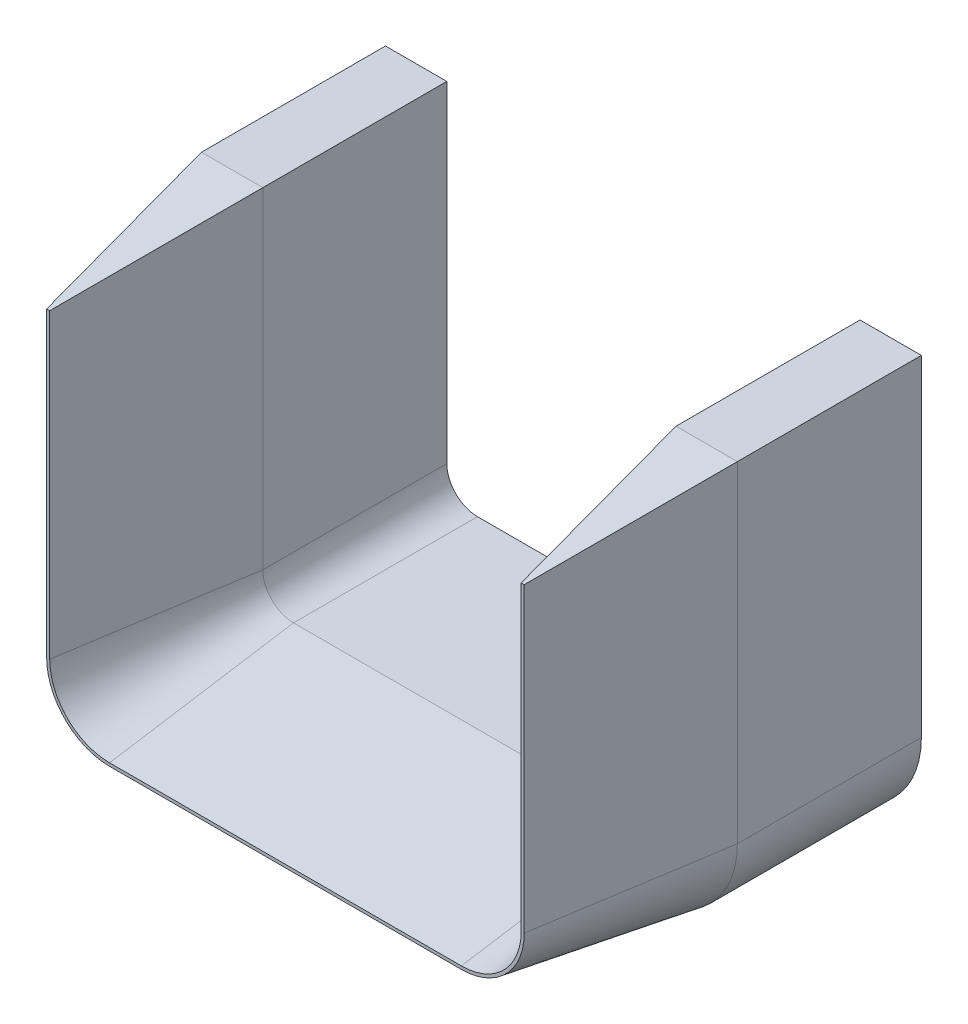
ISO-10303-21;
HEADER;
FILE_DESCRIPTION(('STEP AP214'),'2;1');
FILE_NAME('part.step','',(''),(''),'','','');
FILE_SCHEMA(('AUTOMOTIVE_DESIGN { 1 0 10303 214 1 1 1 1 }'));
ENDSEC;
DATA;
#1=APPLICATION_CONTEXT('core data for automotive mechanical design processes');
#2=APPLICATION_PROTOCOL_DEFINITION('international standard','automotive_design',2000,#1);
#3=PRODUCT_CONTEXT('',#1,'mechanical');
#4=PRODUCT('Part','Part','',(#3));
#5=PRODUCT_RELATED_PRODUCT_CATEGORY('part','',(#4));
#6=PRODUCT_DEFINITION_FORMATION('','',#4);
#7=PRODUCT_DEFINITION_CONTEXT('part definition',#1,'design');
#8=PRODUCT_DEFINITION('design','',#6,#7);
#9=PRODUCT_DEFINITION_SHAPE('','',#8);
#10=(LENGTH_UNIT() NAMED_UNIT(*) SI_UNIT(.MILLI.,.METRE.));
#11=(NAMED_UNIT(*) PLANE_ANGLE_UNIT() SI_UNIT($,.RADIAN.));
#12=(NAMED_UNIT(*) SI_UNIT($,.STERADIAN.) SOLID_ANGLE_UNIT());
#13=UNCERTAINTY_MEASURE_WITH_UNIT(LENGTH_MEASURE(1.E-05),#10,'distance_accuracy_value','');
#14=(GEOMETRIC_REPRESENTATION_CONTEXT(3) GLOBAL_UNCERTAINTY_ASSIGNED_CONTEXT((#13)) GLOBAL_UNIT_ASSIGNED_CONTEXT((#10,
#11,#12)) REPRESENTATION_CONTEXT('',''));
#15=CARTESIAN_POINT('',(0.,0.,0.));
#16=DIRECTION('',(0.,0.,1.));
#17=DIRECTION('',(1.,0.,0.));
#18=AXIS2_PLACEMENT_3D('',#15,#16,#17);
#19=CARTESIAN_POINT('',(-28.2698996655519,24.9115384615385,-30.));
#20=DIRECTION('',(1.,0.,0.));
#21=DIRECTION('',(0.,0.,-1.));
#22=AXIS2_PLACEMENT_3D('',#19,#20,#21);
#23=PLANE('',#22);
#24=DIRECTION('',(0.,1.,0.));
#25=VECTOR('',#24,1.);
#26=CARTESIAN_POINT('',(-28.2698996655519,24.9115384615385,0.));
#27=LINE('',#26,#25);
#28=CARTESIAN_POINT('',(-28.2698996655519,-29.0464882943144,0.));
#29=VERTEX_POINT('',#28);
#30=CARTESIAN_POINT('',(-28.2698996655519,24.9115384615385,0.));
#31=VERTEX_POINT('',#30);
#32=EDGE_CURVE('E152',#29,#31,#27,.T.);
#33=ORIENTED_EDGE('',*,*,#32,.F.);
#34=DIRECTION('',(0.,0.,1.));
#35=VECTOR('',#34,1.);
#36=CARTESIAN_POINT('',(-28.2698996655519,-29.0464882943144,-30.));
#37=LINE('',#36,#35);
#38=CARTESIAN_POINT('',(-28.2698996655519,-29.0464882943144,-30.));
#39=VERTEX_POINT('',#38);
#40=EDGE_CURVE('E11',#39,#29,#37,.T.);
#41=ORIENTED_EDGE('',*,*,#40,.F.);
#42=DIRECTION('',(0.,1.,0.));
#43=VECTOR('',#42,1.);
#44=CARTESIAN_POINT('',(-28.2698996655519,24.9115384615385,-30.));
#45=LINE('',#44,#43);
#46=CARTESIAN_POINT('',(-28.2698996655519,24.9115384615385,-30.));
#47=VERTEX_POINT('',#46);
#48=EDGE_CURVE('E179',#39,#47,#45,.T.);
#49=ORIENTED_EDGE('',*,*,#48,.T.);
#50=DIRECTION('',(0.,0.,1.));
#51=VECTOR('',#50,1.);
#52=CARTESIAN_POINT('',(-28.2698996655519,24.9115384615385,-30.));
#53=LINE('',#52,#51);
#54=EDGE_CURVE('E35',#47,#31,#53,.T.);
#55=ORIENTED_EDGE('',*,*,#54,.T.);
#56=EDGE_LOOP('',(#33,#41,#49,#55));
#57=FACE_BOUND('',#56,.T.);
#58=ADVANCED_FACE('F32',(#57),#23,.T.);
#59=CARTESIAN_POINT('',(-23.2698996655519,-29.0464882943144,-30.));
#60=DIRECTION('',(0.,0.,1.));
#61=DIRECTION('',(1.,0.,0.));
#62=AXIS2_PLACEMENT_3D('',#59,#60,#61);
#63=CYLINDRICAL_SURFACE('',#62,5.);
#64=CARTESIAN_POINT('',(-23.2698996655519,-29.0464882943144,0.));
#65=DIRECTION('',(0.,0.,1.));
#66=DIRECTION('',(1.,0.,0.));
#67=AXIS2_PLACEMENT_3D('',#64,#65,#66);
#68=CIRCLE('',#67,5.);
#69=CARTESIAN_POINT('',(-23.2698996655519,-34.0464882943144,0.));
#70=VERTEX_POINT('',#69);
#71=EDGE_CURVE('E177',#70,#29,#68,.F.);
#72=ORIENTED_EDGE('',*,*,#71,.F.);
#73=DIRECTION('',(0.,0.,1.));
#74=VECTOR('',#73,1.);
#75=CARTESIAN_POINT('',(-23.2698996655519,-34.0464882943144,-30.));
#76=LINE('',#75,#74);
#77=CARTESIAN_POINT('',(-23.2698996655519,-34.0464882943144,-30.));
#78=VERTEX_POINT('',#77);
#79=EDGE_CURVE('E41',#78,#70,#76,.T.);
#80=ORIENTED_EDGE('',*,*,#79,.F.);
#81=CARTESIAN_POINT('',(-23.2698996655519,-29.0464882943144,-30.));
#82=DIRECTION('',(0.,0.,1.));
#83=DIRECTION('',(1.,0.,0.));
#84=AXIS2_PLACEMENT_3D('',#81,#82,#83);
#85=CIRCLE('',#84,5.);
#86=EDGE_CURVE('E142',#78,#39,#85,.F.);
#87=ORIENTED_EDGE('',*,*,#86,.T.);
#88=ORIENTED_EDGE('',*,*,#40,.T.);
#89=EDGE_LOOP('',(#72,#80,#87,#88));
#90=FACE_BOUND('',#89,.T.);
#91=ADVANCED_FACE('F380',(#90),#63,.F.);
#92=CARTESIAN_POINT('',(-23.2698996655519,-34.0464882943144,-30.));
#93=DIRECTION('',(0.,1.,0.));
#94=DIRECTION('',(0.,0.,1.));
#95=AXIS2_PLACEMENT_3D('',#92,#93,#94);
#96=PLANE('',#95);
#97=DIRECTION('',(1.,0.,0.));
#98=VECTOR('',#97,1.);
#99=CARTESIAN_POINT('',(-23.2698996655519,-34.0464882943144,0.));
#100=LINE('',#99,#98);
#101=CARTESIAN_POINT('',(34.1010033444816,-34.0464882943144,0.));
#102=VERTEX_POINT('',#101);
#103=EDGE_CURVE('E132',#102,#70,#100,.F.);
#104=ORIENTED_EDGE('',*,*,#103,.F.);
#105=DIRECTION('',(0.,0.,1.));
#106=VECTOR('',#105,1.);
#107=CARTESIAN_POINT('',(34.1010033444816,-34.0464882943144,-30.));
#108=LINE('',#107,#106);
#109=CARTESIAN_POINT('',(34.1010033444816,-34.0464882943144,-30.));
#110=VERTEX_POINT('',#109);
#111=EDGE_CURVE('E88',#110,#102,#108,.T.);
#112=ORIENTED_EDGE('',*,*,#111,.F.);
#113=DIRECTION('',(1.,0.,0.));
#114=VECTOR('',#113,1.);
#115=CARTESIAN_POINT('',(-23.2698996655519,-34.0464882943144,-30.));
#116=LINE('',#115,#114);
#117=EDGE_CURVE('E129',#110,#78,#116,.F.);
#118=ORIENTED_EDGE('',*,*,#117,.T.);
#119=ORIENTED_EDGE('',*,*,#79,.T.);
#120=EDGE_LOOP('',(#104,#112,#118,#119));
#121=FACE_BOUND('',#120,.T.);
#122=ADVANCED_FACE('F128',(#121),#96,.T.);
#123=CARTESIAN_POINT('',(34.1010033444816,-29.0464882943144,-30.));
#124=DIRECTION('',(0.,0.,1.));
#125=DIRECTION('',(1.,0.,0.));
#126=AXIS2_PLACEMENT_3D('',#123,#124,#125);
#127=CYLINDRICAL_SURFACE('',#126,5.);
#128=CARTESIAN_POINT('',(34.1010033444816,-29.0464882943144,0.));
#129=DIRECTION('',(0.,0.,1.));
#130=DIRECTION('',(1.,0.,0.));
#131=AXIS2_PLACEMENT_3D('',#128,#129,#130);
#132=CIRCLE('',#131,5.);
#133=CARTESIAN_POINT('',(39.1010033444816,-29.0464882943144,0.));
#134=VERTEX_POINT('',#133);
#135=EDGE_CURVE('E174',#134,#102,#132,.F.);
#136=ORIENTED_EDGE('',*,*,#135,.F.);
#137=DIRECTION('',(0.,0.,1.));
#138=VECTOR('',#137,1.);
#139=CARTESIAN_POINT('',(39.1010033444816,-29.0464882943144,-30.));
#140=LINE('',#139,#138);
#141=CARTESIAN_POINT('',(39.1010033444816,-29.0464882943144,-30.));
#142=VERTEX_POINT('',#141);
#143=EDGE_CURVE('E134',#142,#134,#140,.T.);
#144=ORIENTED_EDGE('',*,*,#143,.F.);
#145=CARTESIAN_POINT('',(34.1010033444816,-29.0464882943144,-30.));
#146=DIRECTION('',(0.,0.,1.));
#147=DIRECTION('',(1.,0.,0.));
#148=AXIS2_PLACEMENT_3D('',#145,#146,#147);
#149=CIRCLE('',#148,5.);
#150=EDGE_CURVE('E139',#142,#110,#149,.F.);
#151=ORIENTED_EDGE('',*,*,#150,.T.);
#152=ORIENTED_EDGE('',*,*,#111,.T.);
#153=EDGE_LOOP('',(#136,#144,#151,#152));
#154=FACE_BOUND('',#153,.T.);
#155=ADVANCED_FACE('F144',(#154),#127,.F.);
#156=CARTESIAN_POINT('',(39.1010033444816,24.9115384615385,-30.));
#157=DIRECTION('',(-1.,0.,0.));
#158=DIRECTION('',(0.,0.,1.));
#159=AXIS2_PLACEMENT_3D('',#156,#157,#158);
#160=PLANE('',#159);
#161=DIRECTION('',(0.,1.,0.));
#162=VECTOR('',#161,1.);
#163=CARTESIAN_POINT('',(39.1010033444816,24.9115384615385,0.));
#164=LINE('',#163,#162);
#165=CARTESIAN_POINT('',(39.1010033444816,24.9115384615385,0.));
#166=VERTEX_POINT('',#165);
#167=EDGE_CURVE('E171',#166,#134,#164,.F.);
#168=ORIENTED_EDGE('',*,*,#167,.F.);
#169=DIRECTION('',(0.,0.,1.));
#170=VECTOR('',#169,1.);
#171=CARTESIAN_POINT('',(39.1010033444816,24.9115384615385,-30.));
#172=LINE('',#171,#170);
#173=CARTESIAN_POINT('',(39.1010033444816,24.9115384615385,-30.));
#174=VERTEX_POINT('',#173);
#175=EDGE_CURVE('E183',#174,#166,#172,.T.);
#176=ORIENTED_EDGE('',*,*,#175,.F.);
#177=DIRECTION('',(0.,1.,0.));
#178=VECTOR('',#177,1.);
#179=CARTESIAN_POINT('',(39.1010033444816,24.9115384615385,-30.));
#180=LINE('',#179,#178);
#181=EDGE_CURVE('E145',#174,#142,#180,.F.);
#182=ORIENTED_EDGE('',*,*,#181,.T.);
#183=ORIENTED_EDGE('',*,*,#143,.T.);
#184=EDGE_LOOP('',(#168,#176,#182,#183));
#185=FACE_BOUND('',#184,.T.);
#186=ADVANCED_FACE('F395',(#185),#160,.T.);
#187=CARTESIAN_POINT('',(39.1010033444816,24.9115384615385,-30.));
#188=DIRECTION('',(0.,-1.,0.));
#189=DIRECTION('',(0.,0.,-1.));
#190=AXIS2_PLACEMENT_3D('',#187,#188,#189);
#191=PLANE('',#190);
#192=DIRECTION('',(1.,0.,0.));
#193=VECTOR('',#192,1.);
#194=CARTESIAN_POINT('',(39.1010033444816,24.9115384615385,0.));
#195=LINE('',#194,#193);
#196=CARTESIAN_POINT('',(49.1010033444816,24.9115384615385,0.));
#197=VERTEX_POINT('',#196);
#198=EDGE_CURVE('E169',#166,#197,#195,.T.);
#199=ORIENTED_EDGE('',*,*,#198,.T.);
#200=DIRECTION('',(0.,0.,1.));
#201=VECTOR('',#200,1.);
#202=CARTESIAN_POINT('',(49.1010033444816,24.9115384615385,-30.));
#203=LINE('',#202,#201);
#204=CARTESIAN_POINT('',(49.1010033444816,24.9115384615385,-30.));
#205=VERTEX_POINT('',#204);
#206=EDGE_CURVE('E185',#205,#197,#203,.T.);
#207=ORIENTED_EDGE('',*,*,#206,.F.);
#208=DIRECTION('',(1.,0.,0.));
#209=VECTOR('',#208,1.);
#210=CARTESIAN_POINT('',(39.1010033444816,24.9115384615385,-30.));
#211=LINE('',#210,#209);
#212=EDGE_CURVE('E147',#174,#205,#211,.T.);
#213=ORIENTED_EDGE('',*,*,#212,.F.);
#214=ORIENTED_EDGE('',*,*,#175,.T.);
#215=EDGE_LOOP('',(#199,#207,#213,#214));
#216=FACE_BOUND('',#215,.T.);
#217=ADVANCED_FACE('F307',(#216),#191,.F.);
#218=CARTESIAN_POINT('',(49.1010033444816,24.9115384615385,-30.));
#219=DIRECTION('',(-1.,0.,0.));
#220=DIRECTION('',(0.,0.,1.));
#221=AXIS2_PLACEMENT_3D('',#218,#219,#220);
#222=PLANE('',#221);
#223=DIRECTION('',(0.,-1.,0.));
#224=VECTOR('',#223,1.);
#225=CARTESIAN_POINT('',(49.1010033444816,24.9115384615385,0.));
#226=LINE('',#225,#224);
#227=CARTESIAN_POINT('',(49.1010033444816,-29.0464882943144,0.));
#228=VERTEX_POINT('',#227);
#229=EDGE_CURVE('E167',#197,#228,#226,.T.);
#230=ORIENTED_EDGE('',*,*,#229,.T.);
#231=DIRECTION('',(0.,0.,1.));
#232=VECTOR('',#231,1.);
#233=CARTESIAN_POINT('',(49.1010033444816,-29.0464882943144,-30.));
#234=LINE('',#233,#232);
#235=CARTESIAN_POINT('',(49.1010033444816,-29.0464882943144,-30.));
#236=VERTEX_POINT('',#235);
#237=EDGE_CURVE('E188',#236,#228,#234,.T.);
#238=ORIENTED_EDGE('',*,*,#237,.F.);
#239=DIRECTION('',(0.,-1.,0.));
#240=VECTOR('',#239,1.);
#241=CARTESIAN_POINT('',(49.1010033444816,24.9115384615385,-30.));
#242=LINE('',#241,#240);
#243=EDGE_CURVE('E301',#205,#236,#242,.T.);
#244=ORIENTED_EDGE('',*,*,#243,.F.);
#245=ORIENTED_EDGE('',*,*,#206,.T.);
#246=EDGE_LOOP('',(#230,#238,#244,#245));
#247=FACE_BOUND('',#246,.T.);
#248=ADVANCED_FACE('F310',(#247),#222,.F.);
#249=CARTESIAN_POINT('',(34.1010033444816,-29.0464882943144,-30.));
#250=DIRECTION('',(0.,0.,1.));
#251=DIRECTION('',(1.,0.,0.));
#252=AXIS2_PLACEMENT_3D('',#249,#250,#251);
#253=CYLINDRICAL_SURFACE('',#252,15.);
#254=CARTESIAN_POINT('',(34.1010033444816,-29.0464882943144,0.));
#255=DIRECTION('',(0.,0.,-1.));
#256=DIRECTION('',(1.,0.,0.));
#257=AXIS2_PLACEMENT_3D('',#254,#255,#256);
#258=CIRCLE('',#257,15.);
#259=CARTESIAN_POINT('',(34.1010033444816,-44.0464882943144,0.));
#260=VERTEX_POINT('',#259);
#261=EDGE_CURVE('E165',#228,#260,#258,.T.);
#262=ORIENTED_EDGE('',*,*,#261,.T.);
#263=DIRECTION('',(0.,0.,1.));
#264=VECTOR('',#263,1.);
#265=CARTESIAN_POINT('',(34.1010033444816,-44.0464882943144,-30.));
#266=LINE('',#265,#264);
#267=CARTESIAN_POINT('',(34.1010033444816,-44.0464882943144,-30.));
#268=VERTEX_POINT('',#267);
#269=EDGE_CURVE('E191',#268,#260,#266,.T.);
#270=ORIENTED_EDGE('',*,*,#269,.F.);
#271=CARTESIAN_POINT('',(34.1010033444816,-29.0464882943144,-30.));
#272=DIRECTION('',(0.,0.,-1.));
#273=DIRECTION('',(1.,0.,0.));
#274=AXIS2_PLACEMENT_3D('',#271,#272,#273);
#275=CIRCLE('',#274,15.);
#276=EDGE_CURVE('E299',#236,#268,#275,.T.);
#277=ORIENTED_EDGE('',*,*,#276,.F.);
#278=ORIENTED_EDGE('',*,*,#237,.T.);
#279=EDGE_LOOP('',(#262,#270,#277,#278));
#280=FACE_BOUND('',#279,.T.);
#281=ADVANCED_FACE('F315',(#280),#253,.T.);
#282=CARTESIAN_POINT('',(-23.2698996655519,-44.0464882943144,-30.));
#283=DIRECTION('',(0.,1.,0.));
#284=DIRECTION('',(0.,0.,1.));
#285=AXIS2_PLACEMENT_3D('',#282,#283,#284);
#286=PLANE('',#285);
#287=DIRECTION('',(-1.,0.,0.));
#288=VECTOR('',#287,1.);
#289=CARTESIAN_POINT('',(-23.2698996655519,-44.0464882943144,0.));
#290=LINE('',#289,#288);
#291=CARTESIAN_POINT('',(-23.2698996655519,-44.0464882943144,0.));
#292=VERTEX_POINT('',#291);
#293=EDGE_CURVE('E163',#260,#292,#290,.T.);
#294=ORIENTED_EDGE('',*,*,#293,.T.);
#295=DIRECTION('',(0.,0.,1.));
#296=VECTOR('',#295,1.);
#297=CARTESIAN_POINT('',(-23.2698996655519,-44.0464882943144,-30.));
#298=LINE('',#297,#296);
#299=CARTESIAN_POINT('',(-23.2698996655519,-44.0464882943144,-30.));
#300=VERTEX_POINT('',#299);
#301=EDGE_CURVE('E194',#300,#292,#298,.T.);
#302=ORIENTED_EDGE('',*,*,#301,.F.);
#303=DIRECTION('',(-1.,0.,0.));
#304=VECTOR('',#303,1.);
#305=CARTESIAN_POINT('',(-23.2698996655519,-44.0464882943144,-30.));
#306=LINE('',#305,#304);
#307=EDGE_CURVE('E297',#268,#300,#306,.T.);
#308=ORIENTED_EDGE('',*,*,#307,.F.);
#309=ORIENTED_EDGE('',*,*,#269,.T.);
#310=EDGE_LOOP('',(#294,#302,#308,#309));
#311=FACE_BOUND('',#310,.T.);
#312=ADVANCED_FACE('F321',(#311),#286,.F.);
#313=CARTESIAN_POINT('',(-23.2698996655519,-29.0464882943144,-30.));
#314=DIRECTION('',(0.,0.,1.));
#315=DIRECTION('',(1.,0.,0.));
#316=AXIS2_PLACEMENT_3D('',#313,#314,#315);
#317=CYLINDRICAL_SURFACE('',#316,15.);
#318=CARTESIAN_POINT('',(-23.2698996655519,-29.0464882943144,0.));
#319=DIRECTION('',(0.,0.,-1.));
#320=DIRECTION('',(1.,0.,0.));
#321=AXIS2_PLACEMENT_3D('',#318,#319,#320);
#322=CIRCLE('',#321,15.);
#323=CARTESIAN_POINT('',(-38.2698996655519,-29.0464882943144,0.));
#324=VERTEX_POINT('',#323);
#325=EDGE_CURVE('E161',#292,#324,#322,.T.);
#326=ORIENTED_EDGE('',*,*,#325,.T.);
#327=DIRECTION('',(0.,0.,1.));
#328=VECTOR('',#327,1.);
#329=CARTESIAN_POINT('',(-38.2698996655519,-29.0464882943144,-30.));
#330=LINE('',#329,#328);
#331=CARTESIAN_POINT('',(-38.2698996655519,-29.0464882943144,-30.));
#332=VERTEX_POINT('',#331);
#333=EDGE_CURVE('E197',#332,#324,#330,.T.);
#334=ORIENTED_EDGE('',*,*,#333,.F.);
#335=CARTESIAN_POINT('',(-23.2698996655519,-29.0464882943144,-30.));
#336=DIRECTION('',(0.,0.,-1.));
#337=DIRECTION('',(1.,0.,0.));
#338=AXIS2_PLACEMENT_3D('',#335,#336,#337);
#339=CIRCLE('',#338,15.);
#340=EDGE_CURVE('E295',#300,#332,#339,.T.);
#341=ORIENTED_EDGE('',*,*,#340,.F.);
#342=ORIENTED_EDGE('',*,*,#301,.T.);
#343=EDGE_LOOP('',(#326,#334,#341,#342));
#344=FACE_BOUND('',#343,.T.);
#345=ADVANCED_FACE('F324',(#344),#317,.T.);
#346=CARTESIAN_POINT('',(-38.2698996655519,24.9115384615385,-30.));
#347=DIRECTION('',(1.,0.,0.));
#348=DIRECTION('',(0.,0.,-1.));
#349=AXIS2_PLACEMENT_3D('',#346,#347,#348);
#350=PLANE('',#349);
#351=DIRECTION('',(0.,1.,0.));
#352=VECTOR('',#351,1.);
#353=CARTESIAN_POINT('',(-38.2698996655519,24.9115384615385,0.));
#354=LINE('',#353,#352);
#355=CARTESIAN_POINT('',(-38.2698996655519,24.9115384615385,0.));
#356=VERTEX_POINT('',#355);
#357=EDGE_CURVE('E159',#324,#356,#354,.T.);
#358=ORIENTED_EDGE('',*,*,#357,.T.);
#359=DIRECTION('',(0.,0.,1.));
#360=VECTOR('',#359,1.);
#361=CARTESIAN_POINT('',(-38.2698996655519,24.9115384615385,-30.));
#362=LINE('',#361,#360);
#363=CARTESIAN_POINT('',(-38.2698996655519,24.9115384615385,-30.));
#364=VERTEX_POINT('',#363);
#365=EDGE_CURVE('E199',#364,#356,#362,.T.);
#366=ORIENTED_EDGE('',*,*,#365,.F.);
#367=DIRECTION('',(0.,1.,0.));
#368=VECTOR('',#367,1.);
#369=CARTESIAN_POINT('',(-38.2698996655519,24.9115384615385,-30.));
#370=LINE('',#369,#368);
#371=EDGE_CURVE('E293',#332,#364,#370,.T.);
#372=ORIENTED_EDGE('',*,*,#371,.F.);
#373=ORIENTED_EDGE('',*,*,#333,.T.);
#374=EDGE_LOOP('',(#358,#366,#372,#373));
#375=FACE_BOUND('',#374,.T.);
#376=ADVANCED_FACE('F328',(#375),#350,.F.);
#377=CARTESIAN_POINT('',(-38.2698996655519,24.9115384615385,-30.));
#378=DIRECTION('',(0.,-1.,0.));
#379=DIRECTION('',(0.,0.,-1.));
#380=AXIS2_PLACEMENT_3D('',#377,#378,#379);
#381=PLANE('',#380);
#382=DIRECTION('',(1.,0.,0.));
#383=VECTOR('',#382,1.);
#384=CARTESIAN_POINT('',(-38.2698996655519,24.9115384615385,0.));
#385=LINE('',#384,#383);
#386=EDGE_CURVE('E155',#356,#31,#385,.T.);
#387=ORIENTED_EDGE('',*,*,#386,.T.);
#388=ORIENTED_EDGE('',*,*,#54,.F.);
#389=DIRECTION('',(1.,0.,0.));
#390=VECTOR('',#389,1.);
#391=CARTESIAN_POINT('',(-38.2698996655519,24.9115384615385,-30.));
#392=LINE('',#391,#390);
#393=EDGE_CURVE('E101',#364,#47,#392,.T.);
#394=ORIENTED_EDGE('',*,*,#393,.F.);
#395=ORIENTED_EDGE('',*,*,#365,.T.);
#396=EDGE_LOOP('',(#387,#388,#394,#395));
#397=FACE_BOUND('',#396,.T.);
#398=ADVANCED_FACE('F207',(#397),#381,.F.);
#399=CARTESIAN_POINT('',(-23.2698996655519,-29.0464882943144,-30.));
#400=DIRECTION('',(0.,0.,-1.));
#401=DIRECTION('',(-1.,0.,0.));
#402=AXIS2_PLACEMENT_3D('',#399,#400,#401);
#403=PLANE('',#402);
#404=ORIENTED_EDGE('',*,*,#48,.F.);
#405=ORIENTED_EDGE('',*,*,#86,.F.);
#406=ORIENTED_EDGE('',*,*,#117,.F.);
#407=ORIENTED_EDGE('',*,*,#150,.F.);
#408=ORIENTED_EDGE('',*,*,#181,.F.);
#409=ORIENTED_EDGE('',*,*,#212,.T.);
#410=ORIENTED_EDGE('',*,*,#243,.T.);
#411=ORIENTED_EDGE('',*,*,#276,.T.);
#412=ORIENTED_EDGE('',*,*,#307,.T.);
#413=ORIENTED_EDGE('',*,*,#340,.T.);
#414=ORIENTED_EDGE('',*,*,#371,.T.);
#415=ORIENTED_EDGE('',*,*,#393,.T.);
#416=EDGE_LOOP('',(#404,#405,#406,#407,#408,#409,#410,#411,#412,#413,#414,#415));
#417=FACE_BOUND('',#416,.T.);
#418=ADVANCED_FACE('F137',(#417),#403,.T.);
#419=CARTESIAN_POINT('',(-28.2698996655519,24.9115384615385,0.));
#420=DIRECTION('',(0.987688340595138,0.,0.156434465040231));
#421=DIRECTION('',(0.156434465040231,0.,-0.987688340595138));
#422=AXIS2_PLACEMENT_3D('',#419,#420,#421);
#423=PLANE('',#422);
#424=ORIENTED_EDGE('',*,*,#32,.T.);
#425=DIRECTION('',(-0.154554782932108,-0.154554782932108,0.975820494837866));
#426=VECTOR('',#425,1.);
#427=CARTESIAN_POINT('',(-28.2698996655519,24.9115384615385,0.));
#428=LINE('',#427,#426);
#429=CARTESIAN_POINT('',(-33.0214328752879,20.1600052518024,30.));
#430=VERTEX_POINT('',#429);
#431=EDGE_CURVE('E156',#430,#31,#428,.F.);
#432=ORIENTED_EDGE('',*,*,#431,.F.);
#433=DIRECTION('',(0.,-1.,0.));
#434=VECTOR('',#433,1.);
#435=CARTESIAN_POINT('',(-33.0214328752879,-29.0464882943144,30.));
#436=LINE('',#435,#434);
#437=CARTESIAN_POINT('',(-33.0214328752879,-29.0464882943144,30.));
#438=VERTEX_POINT('',#437);
#439=EDGE_CURVE('E225',#438,#430,#436,.F.);
#440=ORIENTED_EDGE('',*,*,#439,.F.);
#441=DIRECTION('',(0.156434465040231,0.,-0.987688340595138));
#442=VECTOR('',#441,1.);
#443=CARTESIAN_POINT('',(-28.2698996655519,-29.0464882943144,0.));
#444=LINE('',#443,#442);
#445=EDGE_CURVE('E223',#438,#29,#444,.T.);
#446=ORIENTED_EDGE('',*,*,#445,.T.);
#447=EDGE_LOOP('',(#424,#432,#440,#446));
#448=FACE_BOUND('',#447,.T.);
#449=ADVANCED_FACE('F221',(#448),#423,.T.);
#450=CARTESIAN_POINT('',(-38.2698996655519,24.9115384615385,0.));
#451=DIRECTION('',(0.,0.987688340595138,0.156434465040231));
#452=DIRECTION('',(0.,-0.156434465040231,0.987688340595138));
#453=AXIS2_PLACEMENT_3D('',#450,#451,#452);
#454=PLANE('',#453);
#455=ORIENTED_EDGE('',*,*,#386,.F.);
#456=DIRECTION('',(-0.154554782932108,0.154554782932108,-0.975820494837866));
#457=VECTOR('',#456,1.);
#458=CARTESIAN_POINT('',(-38.2698996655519,24.9115384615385,0.));
#459=LINE('',#458,#457);
#460=CARTESIAN_POINT('',(-33.5183664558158,20.1600052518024,30.));
#461=VERTEX_POINT('',#460);
#462=EDGE_CURVE('E218',#461,#356,#459,.T.);
#463=ORIENTED_EDGE('',*,*,#462,.F.);
#464=DIRECTION('',(1.,0.,0.));
#465=VECTOR('',#464,1.);
#466=CARTESIAN_POINT('',(-23.2698996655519,20.1600052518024,30.));
#467=LINE('',#466,#465);
#468=EDGE_CURVE('E215',#461,#430,#467,.T.);
#469=ORIENTED_EDGE('',*,*,#468,.T.);
#470=ORIENTED_EDGE('',*,*,#431,.T.);
#471=EDGE_LOOP('',(#455,#463,#469,#470));
#472=FACE_BOUND('',#471,.T.);
#473=ADVANCED_FACE('F212',(#472),#454,.T.);
#474=CARTESIAN_POINT('',(-38.2698996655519,24.9115384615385,0.));
#475=DIRECTION('',(-0.987688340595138,0.,0.156434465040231));
#476=DIRECTION('',(0.156434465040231,0.,0.987688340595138));
#477=AXIS2_PLACEMENT_3D('',#474,#475,#476);
#478=PLANE('',#477);
#479=ORIENTED_EDGE('',*,*,#357,.F.);
#480=DIRECTION('',(-0.156434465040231,0.,-0.987688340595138));
#481=VECTOR('',#480,1.);
#482=CARTESIAN_POINT('',(-38.2698996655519,-29.0464882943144,0.));
#483=LINE('',#482,#481);
#484=CARTESIAN_POINT('',(-33.5183664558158,-29.0464882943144,30.));
#485=VERTEX_POINT('',#484);
#486=EDGE_CURVE('E259',#485,#324,#483,.T.);
#487=ORIENTED_EDGE('',*,*,#486,.F.);
#488=DIRECTION('',(0.,1.,0.));
#489=VECTOR('',#488,1.);
#490=CARTESIAN_POINT('',(-33.5183664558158,-29.0464882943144,30.));
#491=LINE('',#490,#489);
#492=EDGE_CURVE('E265',#485,#461,#491,.T.);
#493=ORIENTED_EDGE('',*,*,#492,.T.);
#494=ORIENTED_EDGE('',*,*,#462,.T.);
#495=EDGE_LOOP('',(#479,#487,#493,#494));
#496=FACE_BOUND('',#495,.T.);
#497=ADVANCED_FACE('F332',(#496),#478,.T.);
#498=CARTESIAN_POINT('',(-23.2698996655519,-29.0464882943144,0.));
#499=DIRECTION('',(0.,0.,-1.));
#500=DIRECTION('',(1.,0.,0.));
#501=AXIS2_PLACEMENT_3D('',#498,#499,#500);
#502=CONICAL_SURFACE('',#501,15.,0.15707963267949);
#503=ORIENTED_EDGE('',*,*,#325,.F.);
#504=DIRECTION('',(0.,-0.156434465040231,-0.987688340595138));
#505=VECTOR('',#504,1.);
#506=CARTESIAN_POINT('',(-23.2698996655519,-44.0464882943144,0.));
#507=LINE('',#506,#505);
#508=CARTESIAN_POINT('',(-23.2698996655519,-39.2949550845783,30.));
#509=VERTEX_POINT('',#508);
#510=EDGE_CURVE('E256',#509,#292,#507,.T.);
#511=ORIENTED_EDGE('',*,*,#510,.F.);
#512=CARTESIAN_POINT('',(-23.2698996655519,-29.0464882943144,30.));
#513=DIRECTION('',(0.,0.,-1.));
#514=DIRECTION('',(-1.,0.,0.));
#515=AXIS2_PLACEMENT_3D('',#512,#513,#514);
#516=CIRCLE('',#515,10.2484667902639);
#517=EDGE_CURVE('E268',#509,#485,#516,.T.);
#518=ORIENTED_EDGE('',*,*,#517,.T.);
#519=ORIENTED_EDGE('',*,*,#486,.T.);
#520=EDGE_LOOP('',(#503,#511,#518,#519));
#521=FACE_BOUND('',#520,.T.);
#522=ADVANCED_FACE('F423',(#521),#502,.T.);
#523=CARTESIAN_POINT('',(-23.2698996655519,-44.0464882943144,0.));
#524=DIRECTION('',(0.,-0.987688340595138,0.156434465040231));
#525=DIRECTION('',(0.,-0.156434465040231,-0.987688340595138));
#526=AXIS2_PLACEMENT_3D('',#523,#524,#525);
#527=PLANE('',#526);
#528=ORIENTED_EDGE('',*,*,#293,.F.);
#529=DIRECTION('',(0.,-0.156434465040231,-0.987688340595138));
#530=VECTOR('',#529,1.);
#531=CARTESIAN_POINT('',(34.1010033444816,-44.0464882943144,0.));
#532=LINE('',#531,#530);
#533=CARTESIAN_POINT('',(34.1010033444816,-39.2949550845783,30.));
#534=VERTEX_POINT('',#533);
#535=EDGE_CURVE('E253',#534,#260,#532,.T.);
#536=ORIENTED_EDGE('',*,*,#535,.F.);
#537=DIRECTION('',(-1.,0.,0.));
#538=VECTOR('',#537,1.);
#539=CARTESIAN_POINT('',(-23.2698996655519,-39.2949550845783,30.));
#540=LINE('',#539,#538);
#541=EDGE_CURVE('E271',#534,#509,#540,.T.);
#542=ORIENTED_EDGE('',*,*,#541,.T.);
#543=ORIENTED_EDGE('',*,*,#510,.T.);
#544=EDGE_LOOP('',(#528,#536,#542,#543));
#545=FACE_BOUND('',#544,.T.);
#546=ADVANCED_FACE('F428',(#545),#527,.T.);
#547=CARTESIAN_POINT('',(34.1010033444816,-29.0464882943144,0.));
#548=DIRECTION('',(0.,0.,-1.));
#549=DIRECTION('',(1.,0.,0.));
#550=AXIS2_PLACEMENT_3D('',#547,#548,#549);
#551=CONICAL_SURFACE('',#550,15.,0.15707963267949);
#552=ORIENTED_EDGE('',*,*,#261,.F.);
#553=DIRECTION('',(0.156434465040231,0.,-0.987688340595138));
#554=VECTOR('',#553,1.);
#555=CARTESIAN_POINT('',(49.1010033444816,-29.0464882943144,0.));
#556=LINE('',#555,#554);
#557=CARTESIAN_POINT('',(44.3494701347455,-29.0464882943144,30.));
#558=VERTEX_POINT('',#557);
#559=EDGE_CURVE('E250',#558,#228,#556,.T.);
#560=ORIENTED_EDGE('',*,*,#559,.F.);
#561=CARTESIAN_POINT('',(34.1010033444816,-29.0464882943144,30.));
#562=DIRECTION('',(0.,0.,-1.));
#563=DIRECTION('',(-1.,0.,0.));
#564=AXIS2_PLACEMENT_3D('',#561,#562,#563);
#565=CIRCLE('',#564,10.2484667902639);
#566=EDGE_CURVE('E274',#558,#534,#565,.T.);
#567=ORIENTED_EDGE('',*,*,#566,.T.);
#568=ORIENTED_EDGE('',*,*,#535,.T.);
#569=EDGE_LOOP('',(#552,#560,#567,#568));
#570=FACE_BOUND('',#569,.T.);
#571=ADVANCED_FACE('F432',(#570),#551,.T.);
#572=CARTESIAN_POINT('',(49.1010033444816,24.9115384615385,0.));
#573=DIRECTION('',(0.987688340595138,0.,0.156434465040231));
#574=DIRECTION('',(0.156434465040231,0.,-0.987688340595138));
#575=AXIS2_PLACEMENT_3D('',#572,#573,#574);
#576=PLANE('',#575);
#577=ORIENTED_EDGE('',*,*,#229,.F.);
#578=DIRECTION('',(0.154554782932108,0.154554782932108,-0.975820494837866));
#579=VECTOR('',#578,1.);
#580=CARTESIAN_POINT('',(48.8621315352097,24.6726666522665,1.50817724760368));
#581=LINE('',#580,#579);
#582=CARTESIAN_POINT('',(44.3494701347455,20.1600052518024,30.));
#583=VERTEX_POINT('',#582);
#584=EDGE_CURVE('E247',#583,#197,#581,.T.);
#585=ORIENTED_EDGE('',*,*,#584,.F.);
#586=DIRECTION('',(0.,-1.,0.));
#587=VECTOR('',#586,1.);
#588=CARTESIAN_POINT('',(44.3494701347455,-29.0464882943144,30.));
#589=LINE('',#588,#587);
#590=EDGE_CURVE('E277',#583,#558,#589,.T.);
#591=ORIENTED_EDGE('',*,*,#590,.T.);
#592=ORIENTED_EDGE('',*,*,#559,.T.);
#593=EDGE_LOOP('',(#577,#585,#591,#592));
#594=FACE_BOUND('',#593,.T.);
#595=ADVANCED_FACE('F436',(#594),#576,.T.);
#596=CARTESIAN_POINT('',(39.1010033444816,24.9115384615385,0.));
#597=DIRECTION('',(0.,0.987688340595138,0.156434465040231));
#598=DIRECTION('',(0.,-0.156434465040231,0.987688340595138));
#599=AXIS2_PLACEMENT_3D('',#596,#597,#598);
#600=PLANE('',#599);
#601=ORIENTED_EDGE('',*,*,#198,.F.);
#602=DIRECTION('',(0.154554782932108,-0.154554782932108,0.975820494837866));
#603=VECTOR('',#602,1.);
#604=CARTESIAN_POINT('',(39.1010033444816,24.9115384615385,0.));
#605=LINE('',#604,#603);
#606=CARTESIAN_POINT('',(43.8525365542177,20.1600052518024,30.));
#607=VERTEX_POINT('',#606);
#608=EDGE_CURVE('E244',#607,#166,#605,.F.);
#609=ORIENTED_EDGE('',*,*,#608,.F.);
#610=DIRECTION('',(1.,0.,0.));
#611=VECTOR('',#610,1.);
#612=CARTESIAN_POINT('',(-23.2698996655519,20.1600052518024,30.));
#613=LINE('',#612,#611);
#614=EDGE_CURVE('E280',#607,#583,#613,.T.);
#615=ORIENTED_EDGE('',*,*,#614,.T.);
#616=ORIENTED_EDGE('',*,*,#584,.T.);
#617=EDGE_LOOP('',(#601,#609,#615,#616));
#618=FACE_BOUND('',#617,.T.);
#619=ADVANCED_FACE('F440',(#618),#600,.T.);
#620=CARTESIAN_POINT('',(39.1010033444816,24.9115384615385,0.));
#621=DIRECTION('',(-0.987688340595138,0.,0.156434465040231));
#622=DIRECTION('',(0.156434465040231,0.,0.987688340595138));
#623=AXIS2_PLACEMENT_3D('',#620,#621,#622);
#624=PLANE('',#623);
#625=ORIENTED_EDGE('',*,*,#167,.T.);
#626=DIRECTION('',(-0.156434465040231,0.,-0.987688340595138));
#627=VECTOR('',#626,1.);
#628=CARTESIAN_POINT('',(39.1010033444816,-29.0464882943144,0.));
#629=LINE('',#628,#627);
#630=CARTESIAN_POINT('',(43.8525365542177,-29.0464882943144,30.));
#631=VERTEX_POINT('',#630);
#632=EDGE_CURVE('E241',#631,#134,#629,.T.);
#633=ORIENTED_EDGE('',*,*,#632,.F.);
#634=DIRECTION('',(0.,1.,0.));
#635=VECTOR('',#634,1.);
#636=CARTESIAN_POINT('',(43.8525365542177,-29.0464882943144,30.));
#637=LINE('',#636,#635);
#638=EDGE_CURVE('E283',#607,#631,#637,.F.);
#639=ORIENTED_EDGE('',*,*,#638,.F.);
#640=ORIENTED_EDGE('',*,*,#608,.T.);
#641=EDGE_LOOP('',(#625,#633,#639,#640));
#642=FACE_BOUND('',#641,.T.);
#643=ADVANCED_FACE('F444',(#642),#624,.T.);
#644=CARTESIAN_POINT('',(34.1010033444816,-29.0464882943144,0.));
#645=DIRECTION('',(0.,0.,1.));
#646=DIRECTION('',(1.,0.,0.));
#647=AXIS2_PLACEMENT_3D('',#644,#645,#646);
#648=CONICAL_SURFACE('',#647,5.,0.15707963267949);
#649=ORIENTED_EDGE('',*,*,#135,.T.);
#650=DIRECTION('',(0.,0.156434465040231,-0.987688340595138));
#651=VECTOR('',#650,1.);
#652=CARTESIAN_POINT('',(34.1010033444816,-34.0464882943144,0.));
#653=LINE('',#652,#651);
#654=CARTESIAN_POINT('',(34.1010033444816,-38.7980215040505,30.));
#655=VERTEX_POINT('',#654);
#656=EDGE_CURVE('E233',#655,#102,#653,.T.);
#657=ORIENTED_EDGE('',*,*,#656,.F.);
#658=CARTESIAN_POINT('',(34.1010033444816,-29.0464882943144,30.));
#659=DIRECTION('',(0.,0.,-1.));
#660=DIRECTION('',(-1.,0.,0.));
#661=AXIS2_PLACEMENT_3D('',#658,#659,#660);
#662=CIRCLE('',#661,9.75153320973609);
#663=EDGE_CURVE('E286',#631,#655,#662,.T.);
#664=ORIENTED_EDGE('',*,*,#663,.F.);
#665=ORIENTED_EDGE('',*,*,#632,.T.);
#666=EDGE_LOOP('',(#649,#657,#664,#665));
#667=FACE_BOUND('',#666,.T.);
#668=ADVANCED_FACE('F376',(#667),#648,.F.);
#669=CARTESIAN_POINT('',(-23.2698996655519,-34.0464882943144,0.));
#670=DIRECTION('',(0.,0.987688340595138,0.156434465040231));
#671=DIRECTION('',(0.,-0.156434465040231,0.987688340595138));
#672=AXIS2_PLACEMENT_3D('',#669,#670,#671);
#673=PLANE('',#672);
#674=ORIENTED_EDGE('',*,*,#103,.T.);
#675=DIRECTION('',(0.,0.156434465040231,-0.987688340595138));
#676=VECTOR('',#675,1.);
#677=CARTESIAN_POINT('',(-23.2698996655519,-34.0464882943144,0.));
#678=LINE('',#677,#676);
#679=CARTESIAN_POINT('',(-23.2698996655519,-38.7980215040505,30.));
#680=VERTEX_POINT('',#679);
#681=EDGE_CURVE('E229',#680,#70,#678,.T.);
#682=ORIENTED_EDGE('',*,*,#681,.F.);
#683=DIRECTION('',(1.,0.,0.));
#684=VECTOR('',#683,1.);
#685=CARTESIAN_POINT('',(-23.2698996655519,-38.7980215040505,30.));
#686=LINE('',#685,#684);
#687=EDGE_CURVE('E236',#655,#680,#686,.F.);
#688=ORIENTED_EDGE('',*,*,#687,.F.);
#689=ORIENTED_EDGE('',*,*,#656,.T.);
#690=EDGE_LOOP('',(#674,#682,#688,#689));
#691=FACE_BOUND('',#690,.T.);
#692=ADVANCED_FACE('F367',(#691),#673,.T.);
#693=CARTESIAN_POINT('',(-23.2698996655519,-29.0464882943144,0.));
#694=DIRECTION('',(0.,0.,1.));
#695=DIRECTION('',(1.,0.,0.));
#696=AXIS2_PLACEMENT_3D('',#693,#694,#695);
#697=CONICAL_SURFACE('',#696,5.,0.15707963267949);
#698=ORIENTED_EDGE('',*,*,#71,.T.);
#699=ORIENTED_EDGE('',*,*,#445,.F.);
#700=CARTESIAN_POINT('',(-23.2698996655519,-29.0464882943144,30.));
#701=DIRECTION('',(0.,0.,-1.));
#702=DIRECTION('',(-1.,0.,0.));
#703=AXIS2_PLACEMENT_3D('',#700,#701,#702);
#704=CIRCLE('',#703,9.75153320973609);
#705=EDGE_CURVE('E230',#680,#438,#704,.T.);
#706=ORIENTED_EDGE('',*,*,#705,.F.);
#707=ORIENTED_EDGE('',*,*,#681,.T.);
#708=EDGE_LOOP('',(#698,#699,#706,#707));
#709=FACE_BOUND('',#708,.T.);
#710=ADVANCED_FACE('F368',(#709),#697,.F.);
#711=CARTESIAN_POINT('',(-23.2698996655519,-29.0464882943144,30.));
#712=DIRECTION('',(0.,0.,-1.));
#713=DIRECTION('',(-1.,0.,0.));
#714=AXIS2_PLACEMENT_3D('',#711,#712,#713);
#715=PLANE('',#714);
#716=ORIENTED_EDGE('',*,*,#439,.T.);
#717=ORIENTED_EDGE('',*,*,#468,.F.);
#718=ORIENTED_EDGE('',*,*,#492,.F.);
#719=ORIENTED_EDGE('',*,*,#517,.F.);
#720=ORIENTED_EDGE('',*,*,#541,.F.);
#721=ORIENTED_EDGE('',*,*,#566,.F.);
#722=ORIENTED_EDGE('',*,*,#590,.F.);
#723=ORIENTED_EDGE('',*,*,#614,.F.);
#724=ORIENTED_EDGE('',*,*,#638,.T.);
#725=ORIENTED_EDGE('',*,*,#663,.T.);
#726=ORIENTED_EDGE('',*,*,#687,.T.);
#727=ORIENTED_EDGE('',*,*,#705,.T.);
#728=EDGE_LOOP('',(#716,#717,#718,#719,#720,#721,#722,#723,#724,#725,#726,#727));
#729=FACE_BOUND('',#728,.T.);
#730=ADVANCED_FACE('F338',(#729),#715,.F.);
#731=CLOSED_SHELL('',(#58,#91,#122,#155,#186,#217,#248,#281,#312,#345,#376,#398,#418,#449,#473,
#497,#522,#546,#571,#595,#619,#643,#668,#692,#710,#730));
#732=MANIFOLD_SOLID_BREP('B2',#731);
#733=ADVANCED_BREP_SHAPE_REPRESENTATION('',(#18,#732),#14);
#734=SHAPE_DEFINITION_REPRESENTATION(#9,#733);
ENDSEC;
END-ISO-10303-21;
